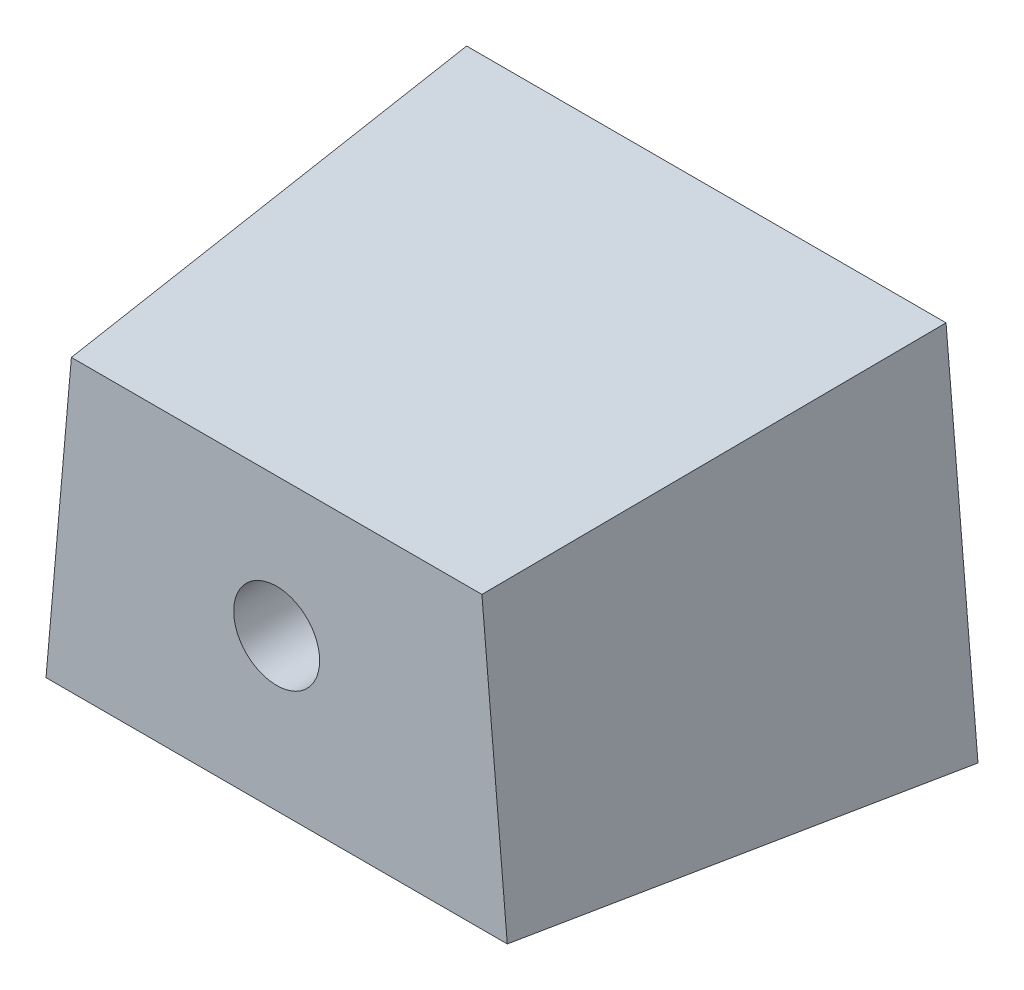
ISO-10303-21;
HEADER;
FILE_DESCRIPTION(('STEP AP214'),'2;1');
FILE_NAME('part.step','',(''),(''),'','','');
FILE_SCHEMA(('AUTOMOTIVE_DESIGN { 1 0 10303 214 1 1 1 1 }'));
ENDSEC;
DATA;
#1=APPLICATION_CONTEXT('core data for automotive mechanical design processes');
#2=APPLICATION_PROTOCOL_DEFINITION('international standard','automotive_design',2000,#1);
#3=PRODUCT_CONTEXT('',#1,'mechanical');
#4=PRODUCT('Part','Part','',(#3));
#5=PRODUCT_RELATED_PRODUCT_CATEGORY('part','',(#4));
#6=PRODUCT_DEFINITION_FORMATION('','',#4);
#7=PRODUCT_DEFINITION_CONTEXT('part definition',#1,'design');
#8=PRODUCT_DEFINITION('design','',#6,#7);
#9=PRODUCT_DEFINITION_SHAPE('','',#8);
#10=(LENGTH_UNIT() NAMED_UNIT(*) SI_UNIT(.MILLI.,.METRE.));
#11=(NAMED_UNIT(*) PLANE_ANGLE_UNIT() SI_UNIT($,.RADIAN.));
#12=(NAMED_UNIT(*) SI_UNIT($,.STERADIAN.) SOLID_ANGLE_UNIT());
#13=UNCERTAINTY_MEASURE_WITH_UNIT(LENGTH_MEASURE(1.E-05),#10,'distance_accuracy_value','');
#14=(GEOMETRIC_REPRESENTATION_CONTEXT(3) GLOBAL_UNCERTAINTY_ASSIGNED_CONTEXT((#13)) GLOBAL_UNIT_ASSIGNED_CONTEXT((#10,
#11,#12)) REPRESENTATION_CONTEXT('',''));
#15=CARTESIAN_POINT('',(0.,0.,0.));
#16=DIRECTION('',(0.,0.,1.));
#17=DIRECTION('',(1.,0.,0.));
#18=AXIS2_PLACEMENT_3D('',#15,#16,#17);
#19=CARTESIAN_POINT('',(-25.5,-20.0051830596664,0.));
#20=DIRECTION('',(-0.992403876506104,0.0868240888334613,0.0871557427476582));
#21=DIRECTION('',(0.0874861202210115,0.,0.996165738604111));
#22=AXIS2_PLACEMENT_3D('',#19,#20,#21);
#23=PLANE('',#22);
#24=DIRECTION('',(0.0871557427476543,0.996194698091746,0.));
#25=VECTOR('',#24,1.);
#26=CARTESIAN_POINT('',(-20.0831373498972,1.75704684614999,40.));
#27=LINE('',#26,#25);
#28=CARTESIAN_POINT('',(-19.1087867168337,12.8939255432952,40.));
#29=VERTEX_POINT('',#28);
#30=CARTESIAN_POINT('',(-21.4710599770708,-14.1069813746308,40.));
#31=VERTEX_POINT('',#30);
#32=EDGE_CURVE('E49',#29,#31,#27,.F.);
#33=ORIENTED_EDGE('',*,*,#32,.F.);
#34=DIRECTION('',(0.0796100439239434,-0.0868791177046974,0.993032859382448));
#35=VECTOR('',#34,1.);
#36=CARTESIAN_POINT('',(-22.0839632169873,16.1407609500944,2.88850148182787));
#37=LINE('',#36,#35);
#38=CARTESIAN_POINT('',(-22.3155303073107,16.3934720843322,0.));
#39=VERTEX_POINT('',#38);
#40=EDGE_CURVE('E82',#29,#39,#37,.F.);
#41=ORIENTED_EDGE('',*,*,#40,.T.);
#42=DIRECTION('',(-0.0871557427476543,-0.996194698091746,0.));
#43=VECTOR('',#42,1.);
#44=CARTESIAN_POINT('',(-25.5,-20.0051830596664,0.));
#45=LINE('',#44,#43);
#46=CARTESIAN_POINT('',(-25.290144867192,-17.6065279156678,0.));
#47=VERTEX_POINT('',#46);
#48=EDGE_CURVE('E95',#39,#47,#45,.T.);
#49=ORIENTED_EDGE('',*,*,#48,.T.);
#50=DIRECTION('',(-0.0946864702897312,-0.0867641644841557,-0.991718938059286));
#51=VECTOR('',#50,1.);
#52=CARTESIAN_POINT('',(-25.3117322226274,-17.6263090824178,-0.226099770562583));
#53=LINE('',#52,#51);
#54=EDGE_CURVE('E64',#47,#31,#53,.F.);
#55=ORIENTED_EDGE('',*,*,#54,.T.);
#56=EDGE_LOOP('',(#33,#41,#49,#55));
#57=FACE_BOUND('',#56,.T.);
#58=ADVANCED_FACE('F40',(#57),#23,.T.);
#59=CARTESIAN_POINT('',(22.,20.,0.));
#60=DIRECTION('',(0.992403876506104,0.086824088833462,0.0871557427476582));
#61=DIRECTION('',(0.0874861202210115,0.,-0.996165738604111));
#62=AXIS2_PLACEMENT_3D('',#59,#60,#61);
#63=PLANE('',#62);
#64=DIRECTION('',(-0.087155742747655,0.996194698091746,0.));
#65=VECTOR('',#64,1.);
#66=CARTESIAN_POINT('',(22.,20.,0.));
#67=LINE('',#66,#65);
#68=CARTESIAN_POINT('',(25.290144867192,-17.6065279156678,0.));
#69=VERTEX_POINT('',#68);
#70=CARTESIAN_POINT('',(22.3155303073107,16.3934720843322,0.));
#71=VERTEX_POINT('',#70);
#72=EDGE_CURVE('E102',#69,#71,#67,.T.);
#73=ORIENTED_EDGE('',*,*,#72,.T.);
#74=DIRECTION('',(0.0796100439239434,0.0868791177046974,-0.993032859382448));
#75=VECTOR('',#74,1.);
#76=CARTESIAN_POINT('',(22.3384749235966,16.4185117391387,-0.286204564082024));
#77=LINE('',#76,#75);
#78=CARTESIAN_POINT('',(19.1087867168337,12.8939255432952,40.));
#79=VERTEX_POINT('',#78);
#80=EDGE_CURVE('E56',#71,#79,#77,.F.);
#81=ORIENTED_EDGE('',*,*,#80,.T.);
#82=DIRECTION('',(0.087155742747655,-0.996194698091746,0.));
#83=VECTOR('',#82,1.);
#84=CARTESIAN_POINT('',(20.0831373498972,1.75704684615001,40.));
#85=LINE('',#84,#83);
#86=CARTESIAN_POINT('',(21.4710599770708,-14.1069813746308,40.));
#87=VERTEX_POINT('',#86);
#88=EDGE_CURVE('E11',#87,#79,#85,.F.);
#89=ORIENTED_EDGE('',*,*,#88,.F.);
#90=DIRECTION('',(-0.0946864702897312,0.0867641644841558,0.991718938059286));
#91=VECTOR('',#90,1.);
#92=CARTESIAN_POINT('',(24.9516945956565,-17.2963953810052,3.5448310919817));
#93=LINE('',#92,#91);
#94=EDGE_CURVE('E122',#87,#69,#93,.F.);
#95=ORIENTED_EDGE('',*,*,#94,.T.);
#96=EDGE_LOOP('',(#73,#81,#89,#95));
#97=FACE_BOUND('',#96,.T.);
#98=ADVANCED_FACE('F42',(#97),#63,.T.);
#99=CARTESIAN_POINT('',(0.,0.,40.));
#100=DIRECTION('',(0.,0.,-1.));
#101=DIRECTION('',(-1.,0.,0.));
#102=AXIS2_PLACEMENT_3D('',#99,#100,#101);
#103=PLANE('',#102);
#104=CARTESIAN_POINT('',(0.,0.,40.));
#105=DIRECTION('',(0.,0.,1.));
#106=DIRECTION('',(1.,0.,0.));
#107=AXIS2_PLACEMENT_3D('',#104,#105,#106);
#108=CIRCLE('',#107,4.);
#109=CARTESIAN_POINT('',(4.,0.,40.));
#110=VERTEX_POINT('',#109);
#111=EDGE_CURVE('E98',#110,#110,#108,.T.);
#112=ORIENTED_EDGE('',*,*,#111,.F.);
#113=EDGE_LOOP('',(#112));
#114=FACE_BOUND('',#113,.T.);
#115=ORIENTED_EDGE('',*,*,#88,.T.);
#116=DIRECTION('',(-1.,0.,0.));
#117=VECTOR('',#116,1.);
#118=CARTESIAN_POINT('',(0.,12.8939255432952,40.));
#119=LINE('',#118,#117);
#120=EDGE_CURVE('E116',#79,#29,#119,.T.);
#121=ORIENTED_EDGE('',*,*,#120,.T.);
#122=ORIENTED_EDGE('',*,*,#32,.T.);
#123=DIRECTION('',(1.,0.,0.));
#124=VECTOR('',#123,1.);
#125=CARTESIAN_POINT('',(0.,-14.1069813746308,40.));
#126=LINE('',#125,#124);
#127=EDGE_CURVE('E89',#31,#87,#126,.T.);
#128=ORIENTED_EDGE('',*,*,#127,.T.);
#129=EDGE_LOOP('',(#115,#121,#122,#128));
#130=FACE_BOUND('',#129,.T.);
#131=ADVANCED_FACE('F114',(#114,#130),#103,.F.);
#132=CARTESIAN_POINT('',(0.,0.,0.));
#133=DIRECTION('',(0.,0.,-1.));
#134=DIRECTION('',(-1.,0.,0.));
#135=AXIS2_PLACEMENT_3D('',#132,#133,#134);
#136=PLANE('',#135);
#137=CARTESIAN_POINT('',(0.,0.,0.));
#138=DIRECTION('',(0.,0.,-1.));
#139=DIRECTION('',(-1.,0.,0.));
#140=AXIS2_PLACEMENT_3D('',#137,#138,#139);
#141=CIRCLE('',#140,4.);
#142=CARTESIAN_POINT('',(-4.,0.,0.));
#143=VERTEX_POINT('',#142);
#144=EDGE_CURVE('E133',#143,#143,#141,.T.);
#145=ORIENTED_EDGE('',*,*,#144,.F.);
#146=EDGE_LOOP('',(#145));
#147=FACE_BOUND('',#146,.T.);
#148=DIRECTION('',(-1.,0.,0.));
#149=VECTOR('',#148,1.);
#150=CARTESIAN_POINT('',(-22.3155303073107,16.3934720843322,0.));
#151=LINE('',#150,#149);
#152=EDGE_CURVE('E79',#71,#39,#151,.T.);
#153=ORIENTED_EDGE('',*,*,#152,.F.);
#154=ORIENTED_EDGE('',*,*,#72,.F.);
#155=DIRECTION('',(1.,0.,0.));
#156=VECTOR('',#155,1.);
#157=CARTESIAN_POINT('',(-25.290144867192,-17.6065279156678,0.));
#158=LINE('',#157,#156);
#159=EDGE_CURVE('E90',#47,#69,#158,.T.);
#160=ORIENTED_EDGE('',*,*,#159,.F.);
#161=ORIENTED_EDGE('',*,*,#48,.F.);
#162=EDGE_LOOP('',(#153,#154,#160,#161));
#163=FACE_BOUND('',#162,.T.);
#164=ADVANCED_FACE('F100',(#147,#163),#136,.T.);
#165=CARTESIAN_POINT('',(0.,0.,32.));
#166=DIRECTION('',(0.,0.,1.));
#167=DIRECTION('',(1.,0.,0.));
#168=AXIS2_PLACEMENT_3D('',#165,#166,#167);
#169=CYLINDRICAL_SURFACE('',#168,4.);
#170=CARTESIAN_POINT('',(0.,0.,32.));
#171=DIRECTION('',(0.,0.,1.));
#172=DIRECTION('',(1.,0.,0.));
#173=AXIS2_PLACEMENT_3D('',#170,#171,#172);
#174=CIRCLE('',#173,4.);
#175=CARTESIAN_POINT('',(4.,0.,32.));
#176=VERTEX_POINT('',#175);
#177=EDGE_CURVE('E103',#176,#176,#174,.T.);
#178=ORIENTED_EDGE('',*,*,#177,.F.);
#179=EDGE_LOOP('',(#178));
#180=FACE_BOUND('',#179,.T.);
#181=ORIENTED_EDGE('',*,*,#111,.T.);
#182=EDGE_LOOP('',(#181));
#183=FACE_BOUND('',#182,.T.);
#184=ADVANCED_FACE('F150',(#180,#183),#169,.F.);
#185=CARTESIAN_POINT('',(0.,0.,32.));
#186=DIRECTION('',(0.,0.,1.));
#187=DIRECTION('',(1.,0.,0.));
#188=AXIS2_PLACEMENT_3D('',#185,#186,#187);
#189=PLANE('',#188);
#190=ORIENTED_EDGE('',*,*,#177,.T.);
#191=EDGE_LOOP('',(#190));
#192=FACE_BOUND('',#191,.T.);
#193=ADVANCED_FACE('F157',(#192),#189,.T.);
#194=CARTESIAN_POINT('',(-25.290144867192,-17.6065279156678,0.));
#195=DIRECTION('',(0.,0.996194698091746,-0.0871557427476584));
#196=DIRECTION('',(0.,0.0871557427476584,0.996194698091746));
#197=AXIS2_PLACEMENT_3D('',#194,#195,#196);
#198=PLANE('',#197);
#199=ORIENTED_EDGE('',*,*,#159,.T.);
#200=ORIENTED_EDGE('',*,*,#94,.F.);
#201=ORIENTED_EDGE('',*,*,#127,.F.);
#202=ORIENTED_EDGE('',*,*,#54,.F.);
#203=EDGE_LOOP('',(#199,#200,#201,#202));
#204=FACE_BOUND('',#203,.T.);
#205=ADVANCED_FACE('F170',(#204),#198,.F.);
#206=CARTESIAN_POINT('',(-22.3155303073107,16.3934720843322,0.));
#207=DIRECTION('',(0.,-0.996194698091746,-0.0871557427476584));
#208=DIRECTION('',(0.,0.0871557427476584,-0.996194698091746));
#209=AXIS2_PLACEMENT_3D('',#206,#207,#208);
#210=PLANE('',#209);
#211=ORIENTED_EDGE('',*,*,#120,.F.);
#212=ORIENTED_EDGE('',*,*,#80,.F.);
#213=ORIENTED_EDGE('',*,*,#152,.T.);
#214=ORIENTED_EDGE('',*,*,#40,.F.);
#215=EDGE_LOOP('',(#211,#212,#213,#214));
#216=FACE_BOUND('',#215,.T.);
#217=ADVANCED_FACE('F81',(#216),#210,.F.);
#218=CARTESIAN_POINT('',(0.,0.,5.));
#219=DIRECTION('',(0.,0.,-1.));
#220=DIRECTION('',(-1.,0.,0.));
#221=AXIS2_PLACEMENT_3D('',#218,#219,#220);
#222=CYLINDRICAL_SURFACE('',#221,4.);
#223=CARTESIAN_POINT('',(0.,0.,5.));
#224=DIRECTION('',(0.,0.,-1.));
#225=DIRECTION('',(-1.,0.,0.));
#226=AXIS2_PLACEMENT_3D('',#223,#224,#225);
#227=CIRCLE('',#226,4.);
#228=CARTESIAN_POINT('',(-4.,0.,5.));
#229=VERTEX_POINT('',#228);
#230=EDGE_CURVE('E131',#229,#229,#227,.T.);
#231=ORIENTED_EDGE('',*,*,#230,.F.);
#232=EDGE_LOOP('',(#231));
#233=FACE_BOUND('',#232,.T.);
#234=ORIENTED_EDGE('',*,*,#144,.T.);
#235=EDGE_LOOP('',(#234));
#236=FACE_BOUND('',#235,.T.);
#237=ADVANCED_FACE('F143',(#233,#236),#222,.F.);
#238=CARTESIAN_POINT('',(0.,0.,5.));
#239=DIRECTION('',(0.,0.,-1.));
#240=DIRECTION('',(-1.,0.,0.));
#241=AXIS2_PLACEMENT_3D('',#238,#239,#240);
#242=PLANE('',#241);
#243=ORIENTED_EDGE('',*,*,#230,.T.);
#244=EDGE_LOOP('',(#243));
#245=FACE_BOUND('',#244,.T.);
#246=ADVANCED_FACE('F141',(#245),#242,.T.);
#247=CLOSED_SHELL('',(#58,#98,#131,#164,#184,#193,#205,#217,#237,#246));
#248=MANIFOLD_SOLID_BREP('B2',#247);
#249=ADVANCED_BREP_SHAPE_REPRESENTATION('',(#18,#248),#14);
#250=SHAPE_DEFINITION_REPRESENTATION(#9,#249);
ENDSEC;
END-ISO-10303-21;
